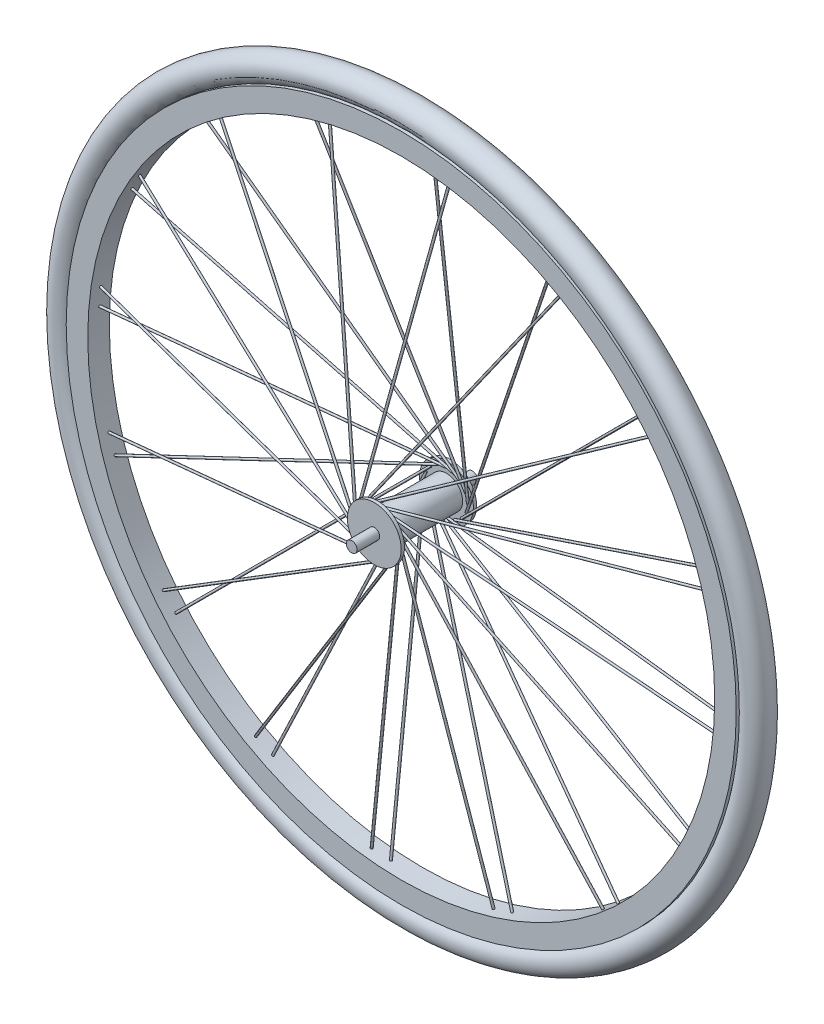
from build123d import *

# Parameters (mm, degrees)
EJE_DEPTH                = 106
EJE_DEPTH_BACK           = 6
SK_EJE_R                 = 5
BUJE_START               = 15
SK_BUJE_R                = 15
BUJE_DEPTH               = 70
PESTANA_IZQ_START        = 15
SK_PESTANA_IZQ_R         = 25
PESTANA_IZQ_DEPTH        = 3
PESTANA_DCHA_START       = 82
SK_PESTANA_DCHA_R        = 25
PESTANA_DCHA_DEPTH       = 3
LLANTA_START             = 40
SK_LLANTA_R              = 311
SK_LLANTA_R_2            = 291
LLANTA_DEPTH             = 20
SK_CUBIERTA_R            = 12.5
SK_RADIO_IZQ_R           = 1
RADIO_IZQ_DEPTH          = 148.030725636
MATRIZ_RADIOS_IZQ_COUNT  = 16
SK_RADIO_DCHA_R          = 1
RADIO_DCHA_DEPTH         = 148.029038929
MATRIZ_RADIOS_DCHA_COUNT = 16


with BuildPart() as part:
    # Sk_Eje → Eje (new, two sides: drawn at the far end of the back side and taken through both)
    with BuildSketch(Plane.XY.offset(-EJE_DEPTH_BACK)):
        Circle(SK_EJE_R)
    extrude(amount=EJE_DEPTH + EJE_DEPTH_BACK)

    # Sk_Buje → Buje (add)
    with BuildSketch(Plane.XY.offset(BUJE_START)):
        Circle(SK_BUJE_R)
    extrude(amount=BUJE_DEPTH)

    # Sk_Pestana_izq → Pestana_izq (add)
    with BuildSketch(Plane.XY.offset(PESTANA_IZQ_START)):
        Circle(SK_PESTANA_IZQ_R)
    extrude(amount=PESTANA_IZQ_DEPTH)

    # Sk_Pestana_dcha → Pestana_dcha (add)
    with BuildSketch(Plane.XY.offset(PESTANA_DCHA_START)):
        Circle(SK_PESTANA_DCHA_R)
    extrude(amount=PESTANA_DCHA_DEPTH)



with BuildPart() as body_2:
    # Sk_Llanta → Llanta (new body)
    with BuildSketch(Plane.XY.offset(LLANTA_START)):
        Circle(SK_LLANTA_R)
        Circle(SK_LLANTA_R_2, mode=Mode.SUBTRACT)
    extrude(amount=LLANTA_DEPTH)

    # Sk_Cubierta → Cubierta (revolve)
    with BuildSketch(Plane(origin=(0, 0, 0), x_dir=(1, 0, 0), z_dir=(0, 1, 0))):
        with Locations((321.5, -50)):
            Circle(SK_CUBIERTA_R)
    revolve(axis=Axis((0, 0, -950), (0, 0, 1)))


with BuildPart() as part_1:
    add(part.part)

    add(body_2.part)  # Radio_izq merges body 2
    # Sk_Radio_izq → Radio_izq (add, symmetric)
    with BuildSketch(Plane(origin=(-147.1635, 20, 34), x_dir=(0.10808566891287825, 0, 0.9941415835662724), z_dir=(-0.9941415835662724, 0, 0.10808566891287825))):
        with Locations(Location((0, 0, 0), (0, 0, 180))):
            Circle(SK_RADIO_IZQ_R)
    radio_izq = extrude(amount=RADIO_IZQ_DEPTH, both=True)

    # Matriz_radios_izq: Radio_izq ×16 about axis
    matriz_radios_izq_axis = Axis((0, 0, 0), (0, 0, 1))
    for i in range(1, MATRIZ_RADIOS_IZQ_COUNT):
        add(radio_izq.rotate(matriz_radios_izq_axis, i * 360 / MATRIZ_RADIOS_IZQ_COUNT))

    # Sk_Radio_dcha → Radio_dcha (add, symmetric)
    with BuildSketch(Plane(origin=(148.236, -9.0945, 66), x_dir=(-0.10600994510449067, 0.02108719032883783, -0.9941414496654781), z_dir=(0.9750384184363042, -0.19395180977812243, -0.10808690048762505))):
        with Locations(Location((0, 0, 0), (0, 0, 270))):
            Circle(SK_RADIO_DCHA_R)
    radio_dcha = extrude(amount=RADIO_DCHA_DEPTH, both=True)

    # Matriz_radios_dcha: Radio_dcha ×16 about axis
    matriz_radios_dcha_axis = Axis((0, 0, 0), (0, 0, 1))
    for i in range(1, MATRIZ_RADIOS_DCHA_COUNT):
        add(radio_dcha.rotate(matriz_radios_dcha_axis, i * 360 / MATRIZ_RADIOS_DCHA_COUNT))


solid = part_1.part
